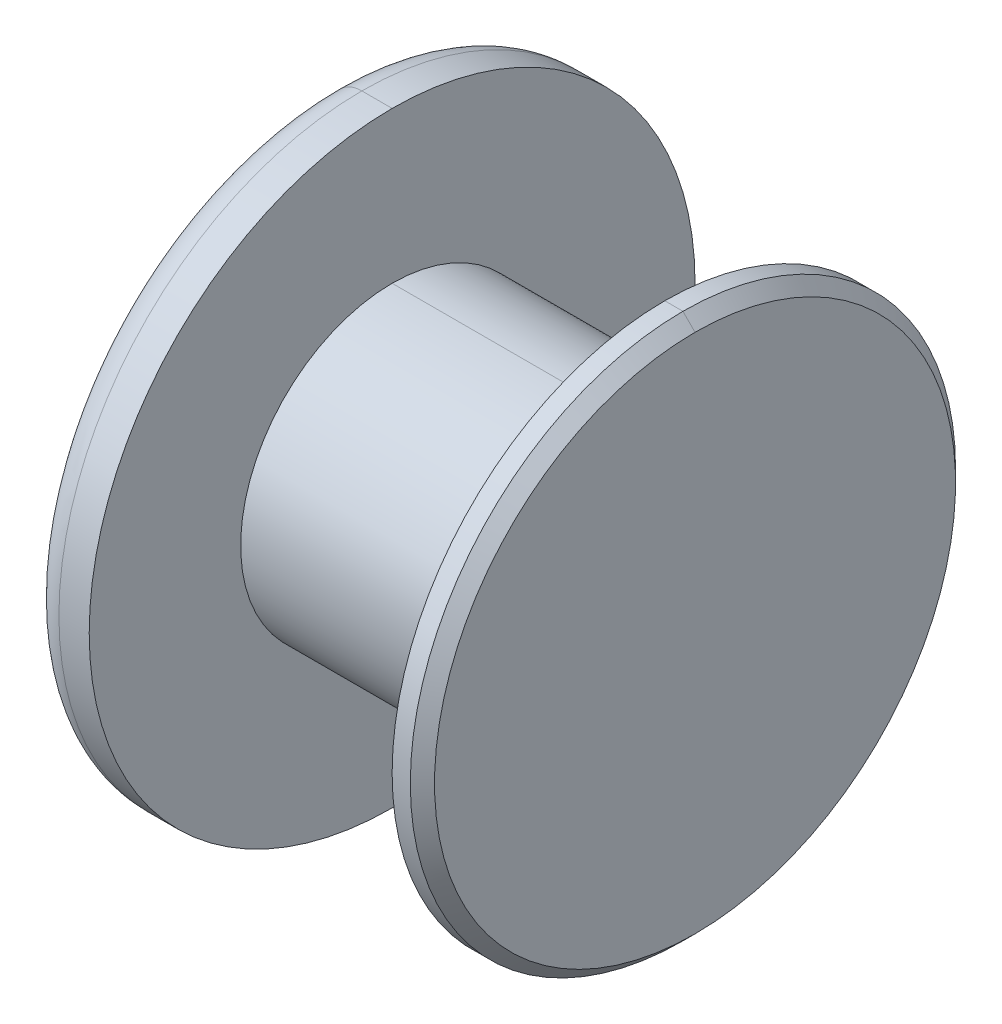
ISO-10303-21;
HEADER;
FILE_DESCRIPTION(('STEP AP214'),'2;1');
FILE_NAME('part.step','',(''),(''),'','','');
FILE_SCHEMA(('AUTOMOTIVE_DESIGN { 1 0 10303 214 1 1 1 1 }'));
ENDSEC;
DATA;
#1=APPLICATION_CONTEXT('core data for automotive mechanical design processes');
#2=APPLICATION_PROTOCOL_DEFINITION('international standard','automotive_design',2000,#1);
#3=PRODUCT_CONTEXT('',#1,'mechanical');
#4=PRODUCT('Part','Part','',(#3));
#5=PRODUCT_RELATED_PRODUCT_CATEGORY('part','',(#4));
#6=PRODUCT_DEFINITION_FORMATION('','',#4);
#7=PRODUCT_DEFINITION_CONTEXT('part definition',#1,'design');
#8=PRODUCT_DEFINITION('design','',#6,#7);
#9=PRODUCT_DEFINITION_SHAPE('','',#8);
#10=(LENGTH_UNIT() NAMED_UNIT(*) SI_UNIT(.MILLI.,.METRE.));
#11=(NAMED_UNIT(*) PLANE_ANGLE_UNIT() SI_UNIT($,.RADIAN.));
#12=(NAMED_UNIT(*) SI_UNIT($,.STERADIAN.) SOLID_ANGLE_UNIT());
#13=UNCERTAINTY_MEASURE_WITH_UNIT(LENGTH_MEASURE(1.E-05),#10,'distance_accuracy_value','');
#14=(GEOMETRIC_REPRESENTATION_CONTEXT(3) GLOBAL_UNCERTAINTY_ASSIGNED_CONTEXT((#13)) GLOBAL_UNIT_ASSIGNED_CONTEXT((#10,
#11,#12)) REPRESENTATION_CONTEXT('',''));
#15=CARTESIAN_POINT('',(0.,0.,0.));
#16=DIRECTION('',(0.,0.,1.));
#17=DIRECTION('',(1.,0.,0.));
#18=AXIS2_PLACEMENT_3D('',#15,#16,#17);
#19=CARTESIAN_POINT('',(2.8,0.,0.));
#20=DIRECTION('',(-1.,0.,0.));
#21=DIRECTION('',(0.,-1.,0.));
#22=AXIS2_PLACEMENT_3D('',#19,#20,#21);
#23=CONICAL_SURFACE('',#22,4.5,0.785398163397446);
#24=DIRECTION('',(-0.707106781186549,0.707106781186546,0.));
#25=VECTOR('',#24,1.);
#26=CARTESIAN_POINT('',(2.8,4.5,0.));
#27=LINE('',#26,#25);
#28=CARTESIAN_POINT('',(3.,4.3,0.));
#29=VERTEX_POINT('',#28);
#30=CARTESIAN_POINT('',(2.8,4.5,0.));
#31=VERTEX_POINT('',#30);
#32=EDGE_CURVE('E157',#29,#31,#27,.T.);
#33=ORIENTED_EDGE('',*,*,#32,.F.);
#34=CARTESIAN_POINT('',(3.,0.,0.));
#35=DIRECTION('',(1.,0.,0.));
#36=DIRECTION('',(0.,-1.,0.));
#37=AXIS2_PLACEMENT_3D('',#34,#35,#36);
#38=CIRCLE('',#37,4.3);
#39=CARTESIAN_POINT('',(3.,-4.3,0.));
#40=VERTEX_POINT('',#39);
#41=EDGE_CURVE('E130',#40,#29,#38,.T.);
#42=ORIENTED_EDGE('',*,*,#41,.F.);
#43=DIRECTION('',(-0.707106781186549,-0.707106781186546,0.));
#44=VECTOR('',#43,1.);
#45=CARTESIAN_POINT('',(2.8,-4.5,0.));
#46=LINE('',#45,#44);
#47=CARTESIAN_POINT('',(2.8,-4.5,0.));
#48=VERTEX_POINT('',#47);
#49=EDGE_CURVE('E145',#40,#48,#46,.T.);
#50=ORIENTED_EDGE('',*,*,#49,.T.);
#51=CARTESIAN_POINT('',(2.8,0.,0.));
#52=DIRECTION('',(-1.,0.,0.));
#53=DIRECTION('',(0.,-1.,0.));
#54=AXIS2_PLACEMENT_3D('',#51,#52,#53);
#55=CIRCLE('',#54,4.5);
#56=EDGE_CURVE('E11',#31,#48,#55,.T.);
#57=ORIENTED_EDGE('',*,*,#56,.F.);
#58=EDGE_LOOP('',(#33,#42,#50,#57));
#59=FACE_BOUND('',#58,.T.);
#60=ADVANCED_FACE('F17',(#59),#23,.T.);
#61=CARTESIAN_POINT('',(-2.5,0.,0.));
#62=DIRECTION('',(1.,0.,0.));
#63=DIRECTION('',(0.,1.,0.));
#64=AXIS2_PLACEMENT_3D('',#61,#62,#63);
#65=TOROIDAL_SURFACE('',#64,4.5,0.5);
#66=CARTESIAN_POINT('',(-2.5,-4.5,0.));
#67=DIRECTION('',(0.,0.,1.));
#68=DIRECTION('',(0.,-1.,0.));
#69=AXIS2_PLACEMENT_3D('',#66,#67,#68);
#70=CIRCLE('',#69,0.5);
#71=CARTESIAN_POINT('',(-3.,-4.5,0.));
#72=VERTEX_POINT('',#71);
#73=CARTESIAN_POINT('',(-2.5,-5.,0.));
#74=VERTEX_POINT('',#73);
#75=EDGE_CURVE('E113',#72,#74,#70,.T.);
#76=ORIENTED_EDGE('',*,*,#75,.F.);
#77=CARTESIAN_POINT('',(-3.,0.,0.));
#78=DIRECTION('',(-1.,0.,0.));
#79=DIRECTION('',(0.,1.,0.));
#80=AXIS2_PLACEMENT_3D('',#77,#78,#79);
#81=CIRCLE('',#80,4.5);
#82=CARTESIAN_POINT('',(-3.,4.5,0.));
#83=VERTEX_POINT('',#82);
#84=EDGE_CURVE('E149',#83,#72,#81,.T.);
#85=ORIENTED_EDGE('',*,*,#84,.F.);
#86=CARTESIAN_POINT('',(-2.5,4.5,0.));
#87=DIRECTION('',(0.,0.,-1.));
#88=DIRECTION('',(-1.,0.,0.));
#89=AXIS2_PLACEMENT_3D('',#86,#87,#88);
#90=CIRCLE('',#89,0.5);
#91=CARTESIAN_POINT('',(-2.5,5.,0.));
#92=VERTEX_POINT('',#91);
#93=EDGE_CURVE('E116',#83,#92,#90,.T.);
#94=ORIENTED_EDGE('',*,*,#93,.T.);
#95=CARTESIAN_POINT('',(-2.5,0.,0.));
#96=DIRECTION('',(1.,0.,0.));
#97=DIRECTION('',(0.,1.,0.));
#98=AXIS2_PLACEMENT_3D('',#95,#96,#97);
#99=CIRCLE('',#98,5.);
#100=EDGE_CURVE('E109',#74,#92,#99,.T.);
#101=ORIENTED_EDGE('',*,*,#100,.F.);
#102=EDGE_LOOP('',(#76,#85,#94,#101));
#103=FACE_BOUND('',#102,.T.);
#104=ADVANCED_FACE('F111',(#103),#65,.T.);
#105=CARTESIAN_POINT('',(-3.,0.,0.));
#106=DIRECTION('',(-1.,0.,0.));
#107=DIRECTION('',(0.,-1.,0.));
#108=AXIS2_PLACEMENT_3D('',#105,#106,#107);
#109=CYLINDRICAL_SURFACE('',#108,4.5);
#110=DIRECTION('',(-1.,0.,0.));
#111=VECTOR('',#110,1.);
#112=CARTESIAN_POINT('',(-3.,4.5,0.));
#113=LINE('',#112,#111);
#114=CARTESIAN_POINT('',(2.5,4.5,0.));
#115=VERTEX_POINT('',#114);
#116=EDGE_CURVE('E189',#31,#115,#113,.T.);
#117=ORIENTED_EDGE('',*,*,#116,.F.);
#118=ORIENTED_EDGE('',*,*,#56,.T.);
#119=DIRECTION('',(-1.,0.,0.));
#120=VECTOR('',#119,1.);
#121=CARTESIAN_POINT('',(-3.,-4.5,0.));
#122=LINE('',#121,#120);
#123=CARTESIAN_POINT('',(2.5,-4.5,0.));
#124=VERTEX_POINT('',#123);
#125=EDGE_CURVE('E161',#48,#124,#122,.T.);
#126=ORIENTED_EDGE('',*,*,#125,.T.);
#127=CARTESIAN_POINT('',(2.5,0.,0.));
#128=DIRECTION('',(-1.,0.,0.));
#129=DIRECTION('',(0.,-1.,0.));
#130=AXIS2_PLACEMENT_3D('',#127,#128,#129);
#131=CIRCLE('',#130,4.5);
#132=EDGE_CURVE('E28',#115,#124,#131,.T.);
#133=ORIENTED_EDGE('',*,*,#132,.F.);
#134=EDGE_LOOP('',(#117,#118,#126,#133));
#135=FACE_BOUND('',#134,.T.);
#136=ADVANCED_FACE('F222',(#135),#109,.T.);
#137=CARTESIAN_POINT('',(2.5,2.5,0.));
#138=DIRECTION('',(1.,0.,0.));
#139=DIRECTION('',(0.,1.,0.));
#140=AXIS2_PLACEMENT_3D('',#137,#138,#139);
#141=PLANE('',#140);
#142=CARTESIAN_POINT('',(2.5,0.,0.));
#143=DIRECTION('',(-1.,0.,0.));
#144=DIRECTION('',(0.,-1.,0.));
#145=AXIS2_PLACEMENT_3D('',#142,#143,#144);
#146=CIRCLE('',#145,2.5);
#147=CARTESIAN_POINT('',(2.5,-2.5,0.));
#148=VERTEX_POINT('',#147);
#149=CARTESIAN_POINT('',(2.5,2.5,0.));
#150=VERTEX_POINT('',#149);
#151=EDGE_CURVE('E164',#148,#150,#146,.T.);
#152=ORIENTED_EDGE('',*,*,#151,.F.);
#153=CARTESIAN_POINT('',(2.5,0.,0.));
#154=DIRECTION('',(-1.,0.,0.));
#155=DIRECTION('',(0.,-1.,0.));
#156=AXIS2_PLACEMENT_3D('',#153,#154,#155);
#157=CIRCLE('',#156,2.5);
#158=EDGE_CURVE('E160',#150,#148,#157,.T.);
#159=ORIENTED_EDGE('',*,*,#158,.F.);
#160=EDGE_LOOP('',(#152,#159));
#161=FACE_BOUND('',#160,.T.);
#162=CARTESIAN_POINT('',(2.5,0.,0.));
#163=DIRECTION('',(-1.,0.,0.));
#164=DIRECTION('',(0.,-1.,0.));
#165=AXIS2_PLACEMENT_3D('',#162,#163,#164);
#166=CIRCLE('',#165,4.5);
#167=EDGE_CURVE('E165',#124,#115,#166,.T.);
#168=ORIENTED_EDGE('',*,*,#167,.T.);
#169=ORIENTED_EDGE('',*,*,#132,.T.);
#170=EDGE_LOOP('',(#168,#169));
#171=FACE_BOUND('',#170,.T.);
#172=ADVANCED_FACE('F220',(#161,#171),#141,.F.);
#173=CARTESIAN_POINT('',(-3.,0.,0.));
#174=DIRECTION('',(-1.,0.,0.));
#175=DIRECTION('',(0.,-1.,0.));
#176=AXIS2_PLACEMENT_3D('',#173,#174,#175);
#177=CYLINDRICAL_SURFACE('',#176,2.5);
#178=DIRECTION('',(-1.,0.,0.));
#179=VECTOR('',#178,1.);
#180=CARTESIAN_POINT('',(-3.,2.5,0.));
#181=LINE('',#180,#179);
#182=CARTESIAN_POINT('',(-2.,2.5,0.));
#183=VERTEX_POINT('',#182);
#184=EDGE_CURVE('E178',#150,#183,#181,.T.);
#185=ORIENTED_EDGE('',*,*,#184,.F.);
#186=ORIENTED_EDGE('',*,*,#158,.T.);
#187=DIRECTION('',(-1.,0.,0.));
#188=VECTOR('',#187,1.);
#189=CARTESIAN_POINT('',(-3.,-2.5,0.));
#190=LINE('',#189,#188);
#191=CARTESIAN_POINT('',(-2.,-2.5,0.));
#192=VERTEX_POINT('',#191);
#193=EDGE_CURVE('E183',#148,#192,#190,.T.);
#194=ORIENTED_EDGE('',*,*,#193,.T.);
#195=CARTESIAN_POINT('',(-2.,0.,0.));
#196=DIRECTION('',(-1.,0.,0.));
#197=DIRECTION('',(0.,-1.,0.));
#198=AXIS2_PLACEMENT_3D('',#195,#196,#197);
#199=CIRCLE('',#198,2.5);
#200=EDGE_CURVE('E121',#183,#192,#199,.T.);
#201=ORIENTED_EDGE('',*,*,#200,.F.);
#202=EDGE_LOOP('',(#185,#186,#194,#201));
#203=FACE_BOUND('',#202,.T.);
#204=ADVANCED_FACE('F218',(#203),#177,.T.);
#205=CARTESIAN_POINT('',(-2.,5.,0.));
#206=DIRECTION('',(-1.,0.,0.));
#207=DIRECTION('',(0.,1.,0.));
#208=AXIS2_PLACEMENT_3D('',#205,#206,#207);
#209=PLANE('',#208);
#210=CARTESIAN_POINT('',(-2.,0.,0.));
#211=DIRECTION('',(-1.,0.,0.));
#212=DIRECTION('',(0.,-1.,0.));
#213=AXIS2_PLACEMENT_3D('',#210,#211,#212);
#214=CIRCLE('',#213,2.5);
#215=EDGE_CURVE('E182',#192,#183,#214,.T.);
#216=ORIENTED_EDGE('',*,*,#215,.T.);
#217=ORIENTED_EDGE('',*,*,#200,.T.);
#218=EDGE_LOOP('',(#216,#217));
#219=FACE_BOUND('',#218,.T.);
#220=CARTESIAN_POINT('',(-2.,0.,0.));
#221=DIRECTION('',(-1.,0.,0.));
#222=DIRECTION('',(0.,-1.,0.));
#223=AXIS2_PLACEMENT_3D('',#220,#221,#222);
#224=CIRCLE('',#223,5.);
#225=CARTESIAN_POINT('',(-2.,-5.,0.));
#226=VERTEX_POINT('',#225);
#227=CARTESIAN_POINT('',(-2.,5.,0.));
#228=VERTEX_POINT('',#227);
#229=EDGE_CURVE('E174',#226,#228,#224,.T.);
#230=ORIENTED_EDGE('',*,*,#229,.F.);
#231=CARTESIAN_POINT('',(-2.,0.,0.));
#232=DIRECTION('',(-1.,0.,0.));
#233=DIRECTION('',(0.,-1.,0.));
#234=AXIS2_PLACEMENT_3D('',#231,#232,#233);
#235=CIRCLE('',#234,5.);
#236=EDGE_CURVE('E21',#228,#226,#235,.T.);
#237=ORIENTED_EDGE('',*,*,#236,.F.);
#238=EDGE_LOOP('',(#230,#237));
#239=FACE_BOUND('',#238,.T.);
#240=ADVANCED_FACE('F211',(#219,#239),#209,.F.);
#241=CARTESIAN_POINT('',(-3.,0.,0.));
#242=DIRECTION('',(-1.,0.,0.));
#243=DIRECTION('',(0.,-1.,0.));
#244=AXIS2_PLACEMENT_3D('',#241,#242,#243);
#245=CYLINDRICAL_SURFACE('',#244,5.);
#246=DIRECTION('',(-1.,0.,0.));
#247=VECTOR('',#246,1.);
#248=CARTESIAN_POINT('',(-3.,5.,0.));
#249=LINE('',#248,#247);
#250=EDGE_CURVE('E131',#228,#92,#249,.T.);
#251=ORIENTED_EDGE('',*,*,#250,.F.);
#252=ORIENTED_EDGE('',*,*,#236,.T.);
#253=DIRECTION('',(-1.,0.,0.));
#254=VECTOR('',#253,1.);
#255=CARTESIAN_POINT('',(-3.,-5.,0.));
#256=LINE('',#255,#254);
#257=EDGE_CURVE('E124',#226,#74,#256,.T.);
#258=ORIENTED_EDGE('',*,*,#257,.T.);
#259=ORIENTED_EDGE('',*,*,#100,.T.);
#260=EDGE_LOOP('',(#251,#252,#258,#259));
#261=FACE_BOUND('',#260,.T.);
#262=ADVANCED_FACE('F126',(#261),#245,.T.);
#263=CARTESIAN_POINT('',(-3.,0.,0.));
#264=DIRECTION('',(1.,0.,0.));
#265=DIRECTION('',(0.,1.,0.));
#266=AXIS2_PLACEMENT_3D('',#263,#264,#265);
#267=PLANE('',#266);
#268=ORIENTED_EDGE('',*,*,#84,.T.);
#269=CARTESIAN_POINT('',(-3.,0.,0.));
#270=DIRECTION('',(-1.,0.,0.));
#271=DIRECTION('',(0.,1.,0.));
#272=AXIS2_PLACEMENT_3D('',#269,#270,#271);
#273=CIRCLE('',#272,4.5);
#274=EDGE_CURVE('E138',#72,#83,#273,.T.);
#275=ORIENTED_EDGE('',*,*,#274,.T.);
#276=EDGE_LOOP('',(#268,#275));
#277=FACE_BOUND('',#276,.T.);
#278=ADVANCED_FACE('F238',(#277),#267,.F.);
#279=CARTESIAN_POINT('',(3.,4.5,0.));
#280=DIRECTION('',(-1.,0.,0.));
#281=DIRECTION('',(0.,1.,0.));
#282=AXIS2_PLACEMENT_3D('',#279,#280,#281);
#283=PLANE('',#282);
#284=ORIENTED_EDGE('',*,*,#41,.T.);
#285=CARTESIAN_POINT('',(3.,0.,0.));
#286=DIRECTION('',(1.,0.,0.));
#287=DIRECTION('',(0.,-1.,0.));
#288=AXIS2_PLACEMENT_3D('',#285,#286,#287);
#289=CIRCLE('',#288,4.3);
#290=EDGE_CURVE('E171',#29,#40,#289,.T.);
#291=ORIENTED_EDGE('',*,*,#290,.T.);
#292=EDGE_LOOP('',(#284,#291));
#293=FACE_BOUND('',#292,.T.);
#294=ADVANCED_FACE('F236',(#293),#283,.F.);
#295=CARTESIAN_POINT('',(-3.,0.,0.));
#296=DIRECTION('',(-1.,0.,0.));
#297=DIRECTION('',(0.,-1.,0.));
#298=AXIS2_PLACEMENT_3D('',#295,#296,#297);
#299=CYLINDRICAL_SURFACE('',#298,5.);
#300=ORIENTED_EDGE('',*,*,#229,.T.);
#301=ORIENTED_EDGE('',*,*,#250,.T.);
#302=CARTESIAN_POINT('',(-2.5,0.,0.));
#303=DIRECTION('',(1.,0.,0.));
#304=DIRECTION('',(0.,1.,0.));
#305=AXIS2_PLACEMENT_3D('',#302,#303,#304);
#306=CIRCLE('',#305,5.);
#307=EDGE_CURVE('E133',#92,#74,#306,.T.);
#308=ORIENTED_EDGE('',*,*,#307,.T.);
#309=ORIENTED_EDGE('',*,*,#257,.F.);
#310=EDGE_LOOP('',(#300,#301,#308,#309));
#311=FACE_BOUND('',#310,.T.);
#312=ADVANCED_FACE('F134',(#311),#299,.T.);
#313=CARTESIAN_POINT('',(-3.,0.,0.));
#314=DIRECTION('',(-1.,0.,0.));
#315=DIRECTION('',(0.,-1.,0.));
#316=AXIS2_PLACEMENT_3D('',#313,#314,#315);
#317=CYLINDRICAL_SURFACE('',#316,2.5);
#318=ORIENTED_EDGE('',*,*,#151,.T.);
#319=ORIENTED_EDGE('',*,*,#184,.T.);
#320=ORIENTED_EDGE('',*,*,#215,.F.);
#321=ORIENTED_EDGE('',*,*,#193,.F.);
#322=EDGE_LOOP('',(#318,#319,#320,#321));
#323=FACE_BOUND('',#322,.T.);
#324=ADVANCED_FACE('F215',(#323),#317,.T.);
#325=CARTESIAN_POINT('',(-3.,0.,0.));
#326=DIRECTION('',(-1.,0.,0.));
#327=DIRECTION('',(0.,-1.,0.));
#328=AXIS2_PLACEMENT_3D('',#325,#326,#327);
#329=CYLINDRICAL_SURFACE('',#328,4.5);
#330=CARTESIAN_POINT('',(2.8,0.,0.));
#331=DIRECTION('',(-1.,0.,0.));
#332=DIRECTION('',(0.,-1.,0.));
#333=AXIS2_PLACEMENT_3D('',#330,#331,#332);
#334=CIRCLE('',#333,4.5);
#335=EDGE_CURVE('E153',#48,#31,#334,.T.);
#336=ORIENTED_EDGE('',*,*,#335,.T.);
#337=ORIENTED_EDGE('',*,*,#116,.T.);
#338=ORIENTED_EDGE('',*,*,#167,.F.);
#339=ORIENTED_EDGE('',*,*,#125,.F.);
#340=EDGE_LOOP('',(#336,#337,#338,#339));
#341=FACE_BOUND('',#340,.T.);
#342=ADVANCED_FACE('F227',(#341),#329,.T.);
#343=CARTESIAN_POINT('',(-2.5,0.,0.));
#344=DIRECTION('',(1.,0.,0.));
#345=DIRECTION('',(0.,1.,0.));
#346=AXIS2_PLACEMENT_3D('',#343,#344,#345);
#347=TOROIDAL_SURFACE('',#346,4.5,0.5);
#348=ORIENTED_EDGE('',*,*,#274,.F.);
#349=ORIENTED_EDGE('',*,*,#75,.T.);
#350=ORIENTED_EDGE('',*,*,#307,.F.);
#351=ORIENTED_EDGE('',*,*,#93,.F.);
#352=EDGE_LOOP('',(#348,#349,#350,#351));
#353=FACE_BOUND('',#352,.T.);
#354=ADVANCED_FACE('F19',(#353),#347,.T.);
#355=CARTESIAN_POINT('',(2.8,0.,0.));
#356=DIRECTION('',(-1.,0.,0.));
#357=DIRECTION('',(0.,-1.,0.));
#358=AXIS2_PLACEMENT_3D('',#355,#356,#357);
#359=CONICAL_SURFACE('',#358,4.5,0.785398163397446);
#360=ORIENTED_EDGE('',*,*,#290,.F.);
#361=ORIENTED_EDGE('',*,*,#32,.T.);
#362=ORIENTED_EDGE('',*,*,#335,.F.);
#363=ORIENTED_EDGE('',*,*,#49,.F.);
#364=EDGE_LOOP('',(#360,#361,#362,#363));
#365=FACE_BOUND('',#364,.T.);
#366=ADVANCED_FACE('F234',(#365),#359,.T.);
#367=CLOSED_SHELL('',(#60,#104,#136,#172,#204,#240,#262,#278,#294,#312,#324,#342,#354,#366));
#368=MANIFOLD_SOLID_BREP('B1',#367);
#369=ADVANCED_BREP_SHAPE_REPRESENTATION('',(#18,#368),#14);
#370=SHAPE_DEFINITION_REPRESENTATION(#9,#369);
ENDSEC;
END-ISO-10303-21;
